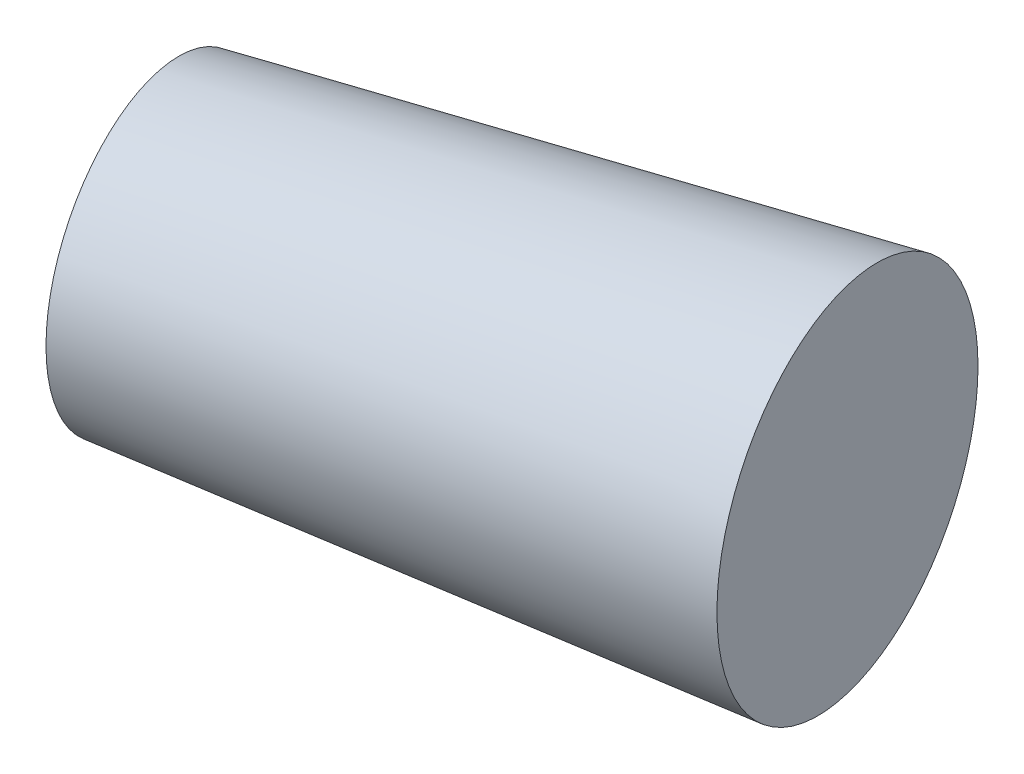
ISO-10303-21;
HEADER;
FILE_DESCRIPTION(('STEP AP214'),'2;1');
FILE_NAME('part.step','',(''),(''),'','','');
FILE_SCHEMA(('AUTOMOTIVE_DESIGN { 1 0 10303 214 1 1 1 1 }'));
ENDSEC;
DATA;
#1=APPLICATION_CONTEXT('core data for automotive mechanical design processes');
#2=APPLICATION_PROTOCOL_DEFINITION('international standard','automotive_design',2000,#1);
#3=PRODUCT_CONTEXT('',#1,'mechanical');
#4=PRODUCT('Part','Part','',(#3));
#5=PRODUCT_RELATED_PRODUCT_CATEGORY('part','',(#4));
#6=PRODUCT_DEFINITION_FORMATION('','',#4);
#7=PRODUCT_DEFINITION_CONTEXT('part definition',#1,'design');
#8=PRODUCT_DEFINITION('design','',#6,#7);
#9=PRODUCT_DEFINITION_SHAPE('','',#8);
#10=(LENGTH_UNIT() NAMED_UNIT(*) SI_UNIT(.MILLI.,.METRE.));
#11=(NAMED_UNIT(*) PLANE_ANGLE_UNIT() SI_UNIT($,.RADIAN.));
#12=(NAMED_UNIT(*) SI_UNIT($,.STERADIAN.) SOLID_ANGLE_UNIT());
#13=UNCERTAINTY_MEASURE_WITH_UNIT(LENGTH_MEASURE(1.E-05),#10,'distance_accuracy_value','');
#14=(GEOMETRIC_REPRESENTATION_CONTEXT(3) GLOBAL_UNCERTAINTY_ASSIGNED_CONTEXT((#13)) GLOBAL_UNIT_ASSIGNED_CONTEXT((#10,
#11,#12)) REPRESENTATION_CONTEXT('',''));
#15=CARTESIAN_POINT('',(0.,0.,0.));
#16=DIRECTION('',(0.,0.,1.));
#17=DIRECTION('',(1.,0.,0.));
#18=AXIS2_PLACEMENT_3D('',#15,#16,#17);
#19=CARTESIAN_POINT('',(4.0865603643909,0.,-0.981835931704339));
#20=DIRECTION('',(0.972329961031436,0.,-0.233611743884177));
#21=DIRECTION('',(-0.233611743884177,0.,-0.972329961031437));
#22=AXIS2_PLACEMENT_3D('',#19,#20,#21);
#23=CONICAL_SURFACE('',#22,3.37499999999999,0.0523598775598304);
#24=CARTESIAN_POINT('',(-6.58920151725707,0.,1.58311984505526));
#25=DIRECTION('',(-0.972329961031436,0.,0.233611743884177));
#26=DIRECTION('',(0.233611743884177,0.,0.972329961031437));
#27=AXIS2_PLACEMENT_3D('',#24,#25,#26);
#28=CIRCLE('',#27,2.79958527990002);
#29=CARTESIAN_POINT('',(-5.93518551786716,0.,4.30524049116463));
#30=VERTEX_POINT('',#29);
#31=EDGE_CURVE('E10',#30,#30,#28,.T.);
#32=ORIENTED_EDGE('',*,*,#31,.F.);
#33=EDGE_LOOP('',(#32));
#34=FACE_BOUND('',#33,.T.);
#35=CARTESIAN_POINT('',(4.0865603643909,0.,-0.981835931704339));
#36=DIRECTION('',(-0.972329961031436,0.,0.233611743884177));
#37=DIRECTION('',(0.233611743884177,0.,0.972329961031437));
#38=AXIS2_PLACEMENT_3D('',#35,#36,#37);
#39=CIRCLE('',#38,3.37499999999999);
#40=CARTESIAN_POINT('',(4.875,0.,2.29977768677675));
#41=VERTEX_POINT('',#40);
#42=EDGE_CURVE('E35',#41,#41,#39,.T.);
#43=ORIENTED_EDGE('',*,*,#42,.T.);
#44=EDGE_LOOP('',(#43));
#45=FACE_BOUND('',#44,.T.);
#46=ADVANCED_FACE('F29',(#34,#45),#23,.T.);
#47=CARTESIAN_POINT('',(-6.58920151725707,0.,1.58311984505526));
#48=DIRECTION('',(0.972329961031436,0.,-0.233611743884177));
#49=DIRECTION('',(-0.233611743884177,0.,-0.972329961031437));
#50=AXIS2_PLACEMENT_3D('',#47,#48,#49);
#51=PLANE('',#50);
#52=ORIENTED_EDGE('',*,*,#31,.T.);
#53=EDGE_LOOP('',(#52));
#54=FACE_BOUND('',#53,.T.);
#55=ADVANCED_FACE('F44',(#54),#51,.F.);
#56=CARTESIAN_POINT('',(4.0865603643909,0.,-0.981835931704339));
#57=DIRECTION('',(-0.972329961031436,0.,0.233611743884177));
#58=DIRECTION('',(0.233611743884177,0.,0.972329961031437));
#59=AXIS2_PLACEMENT_3D('',#56,#57,#58);
#60=PLANE('',#59);
#61=ORIENTED_EDGE('',*,*,#42,.F.);
#62=EDGE_LOOP('',(#61));
#63=FACE_BOUND('',#62,.T.);
#64=ADVANCED_FACE('F42',(#63),#60,.F.);
#65=CLOSED_SHELL('',(#46,#55,#64));
#66=MANIFOLD_SOLID_BREP('B2',#65);
#67=ADVANCED_BREP_SHAPE_REPRESENTATION('',(#18,#66),#14);
#68=SHAPE_DEFINITION_REPRESENTATION(#9,#67);
ENDSEC;
END-ISO-10303-21;
